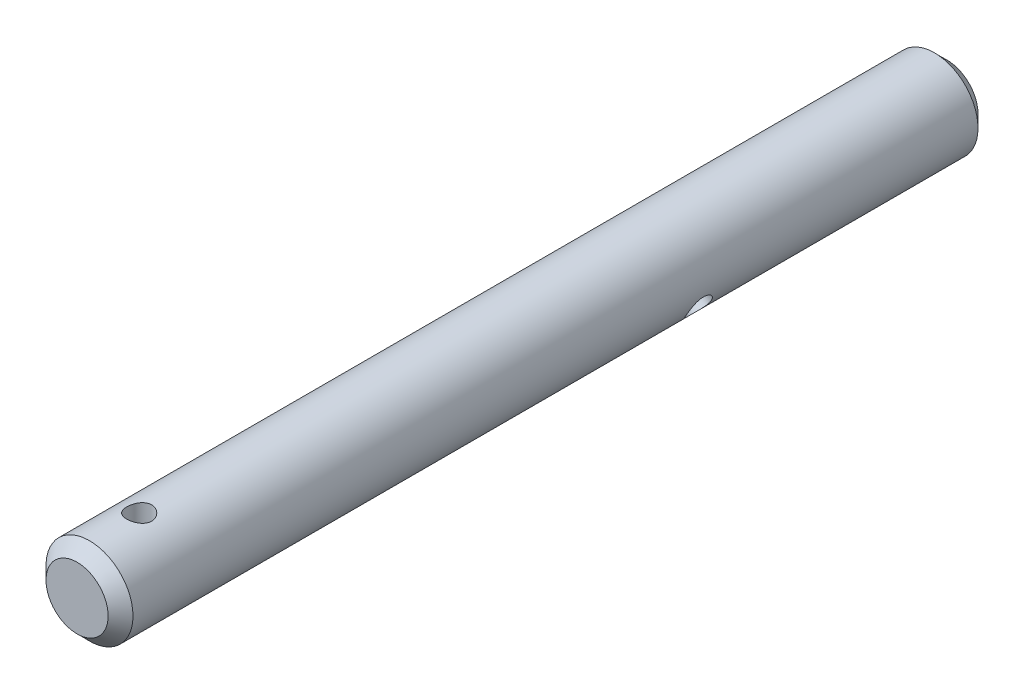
ISO-10303-21;
HEADER;
FILE_DESCRIPTION(('STEP AP214'),'2;1');
FILE_NAME('part.step','',(''),(''),'','','');
FILE_SCHEMA(('AUTOMOTIVE_DESIGN { 1 0 10303 214 1 1 1 1 }'));
ENDSEC;
DATA;
#1=APPLICATION_CONTEXT('core data for automotive mechanical design processes');
#2=APPLICATION_PROTOCOL_DEFINITION('international standard','automotive_design',2000,#1);
#3=PRODUCT_CONTEXT('',#1,'mechanical');
#4=PRODUCT('Part','Part','',(#3));
#5=PRODUCT_RELATED_PRODUCT_CATEGORY('part','',(#4));
#6=PRODUCT_DEFINITION_FORMATION('','',#4);
#7=PRODUCT_DEFINITION_CONTEXT('part definition',#1,'design');
#8=PRODUCT_DEFINITION('design','',#6,#7);
#9=PRODUCT_DEFINITION_SHAPE('','',#8);
#10=(LENGTH_UNIT() NAMED_UNIT(*) SI_UNIT(.MILLI.,.METRE.));
#11=(NAMED_UNIT(*) PLANE_ANGLE_UNIT() SI_UNIT($,.RADIAN.));
#12=(NAMED_UNIT(*) SI_UNIT($,.STERADIAN.) SOLID_ANGLE_UNIT());
#13=UNCERTAINTY_MEASURE_WITH_UNIT(LENGTH_MEASURE(1.E-05),#10,'distance_accuracy_value','');
#14=(GEOMETRIC_REPRESENTATION_CONTEXT(3) GLOBAL_UNCERTAINTY_ASSIGNED_CONTEXT((#13)) GLOBAL_UNIT_ASSIGNED_CONTEXT((#10,
#11,#12)) REPRESENTATION_CONTEXT('',''));
#15=CARTESIAN_POINT('',(0.,0.,0.));
#16=DIRECTION('',(0.,0.,1.));
#17=DIRECTION('',(1.,0.,0.));
#18=AXIS2_PLACEMENT_3D('',#15,#16,#17);
#19=CARTESIAN_POINT('',(0.,0.,69.9999999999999));
#20=DIRECTION('',(0.,0.,-1.));
#21=DIRECTION('',(-1.,0.,0.));
#22=AXIS2_PLACEMENT_3D('',#19,#20,#21);
#23=CYLINDRICAL_SURFACE('',#22,3.5);
#24=CARTESIAN_POINT('',(2.40473750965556,-2.54307638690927,23.));
#25=CARTESIAN_POINT('',(2.4047386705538,-2.54307591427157,23.0549257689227));
#26=CARTESIAN_POINT('',(2.40818904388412,-2.53982602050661,23.1098615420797));
#27=CARTESIAN_POINT('',(2.4217656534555,-2.52688273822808,23.2181356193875));
#28=CARTESIAN_POINT('',(2.43189460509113,-2.51718672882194,23.2714732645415));
#29=CARTESIAN_POINT('',(2.45816904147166,-2.49153342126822,23.3749686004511));
#30=CARTESIAN_POINT('',(2.47430520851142,-2.47558581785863,23.4251310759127));
#31=CARTESIAN_POINT('',(2.51167329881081,-2.43766344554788,23.521083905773));
#32=CARTESIAN_POINT('',(2.53290582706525,-2.41568796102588,23.5668737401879));
#33=CARTESIAN_POINT('',(2.5799853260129,-2.36535216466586,23.6540957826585));
#34=CARTESIAN_POINT('',(2.60593783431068,-2.33684082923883,23.6953839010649));
#35=CARTESIAN_POINT('',(2.66080552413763,-2.27416929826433,23.7711513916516));
#36=CARTESIAN_POINT('',(2.68972105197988,-2.24000844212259,23.8056299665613));
#37=CARTESIAN_POINT('',(2.74977472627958,-2.1658837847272,23.8674143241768));
#38=CARTESIAN_POINT('',(2.7809442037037,-2.12582389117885,23.8945748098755));
#39=CARTESIAN_POINT('',(2.84364186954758,-2.04119320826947,23.940000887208));
#40=CARTESIAN_POINT('',(2.87516998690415,-1.99662329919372,23.9582682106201));
#41=CARTESIAN_POINT('',(2.93647327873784,-1.90527427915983,23.9849172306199));
#42=CARTESIAN_POINT('',(2.96627272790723,-1.85858319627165,23.9935445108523));
#43=CARTESIAN_POINT('',(3.02391437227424,-1.76324762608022,24.0014433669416));
#44=CARTESIAN_POINT('',(3.0517569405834,-1.71460351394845,24.0007167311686));
#45=CARTESIAN_POINT('',(3.10389179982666,-1.6182617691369,23.9900968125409));
#46=CARTESIAN_POINT('',(3.12826346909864,-1.57057743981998,23.980469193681));
#47=CARTESIAN_POINT('',(3.17389396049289,-1.47619326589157,23.9527524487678));
#48=CARTESIAN_POINT('',(3.19515259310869,-1.42949348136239,23.9346628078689));
#49=CARTESIAN_POINT('',(3.23454562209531,-1.33799296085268,23.890345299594));
#50=CARTESIAN_POINT('',(3.25264331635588,-1.29321857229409,23.8640306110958));
#51=CARTESIAN_POINT('',(3.28543541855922,-1.20748661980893,23.804077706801));
#52=CARTESIAN_POINT('',(3.30012907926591,-1.16652989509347,23.7704378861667));
#53=CARTESIAN_POINT('',(3.32674298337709,-1.08836895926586,23.6953971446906));
#54=CARTESIAN_POINT('',(3.33854779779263,-1.05134688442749,23.6537652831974));
#55=CARTESIAN_POINT('',(3.35898852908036,-0.984090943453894,23.564642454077));
#56=CARTESIAN_POINT('',(3.36762418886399,-0.953857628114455,23.5171510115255));
#57=CARTESIAN_POINT('',(3.38210690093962,-0.901170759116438,23.4171345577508));
#58=CARTESIAN_POINT('',(3.38793113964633,-0.878781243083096,23.3645723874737));
#59=CARTESIAN_POINT('',(3.39697422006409,-0.843153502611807,23.2562234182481));
#60=CARTESIAN_POINT('',(3.40019381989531,-0.829912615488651,23.2004375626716));
#61=CARTESIAN_POINT('',(3.40415003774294,-0.813530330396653,23.0892597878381));
#62=CARTESIAN_POINT('',(3.4049674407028,-0.81006050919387,23.0339190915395));
#63=CARTESIAN_POINT('',(3.40439772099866,-0.812451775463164,22.9234558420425));
#64=CARTESIAN_POINT('',(3.4030108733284,-0.818311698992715,22.8683332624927));
#65=CARTESIAN_POINT('',(3.39801027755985,-0.83882785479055,22.7611793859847));
#66=CARTESIAN_POINT('',(3.39444824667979,-0.853279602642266,22.7091062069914));
#67=CARTESIAN_POINT('',(3.38496192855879,-0.890164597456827,22.6080990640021));
#68=CARTESIAN_POINT('',(3.37903730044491,-0.912598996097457,22.5591655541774));
#69=CARTESIAN_POINT('',(3.3643945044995,-0.965199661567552,22.4644889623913));
#70=CARTESIAN_POINT('',(3.35561084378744,-0.995543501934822,22.4188547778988));
#71=CARTESIAN_POINT('',(3.33499786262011,-1.06255152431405,22.3332618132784));
#72=CARTESIAN_POINT('',(3.3231678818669,-1.09921707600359,22.2933042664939));
#73=CARTESIAN_POINT('',(3.29573585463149,-1.17896532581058,22.2188102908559));
#74=CARTESIAN_POINT('',(3.28001991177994,-1.22222292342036,22.1845025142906));
#75=CARTESIAN_POINT('',(3.24486462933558,-1.31270936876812,22.1239771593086));
#76=CARTESIAN_POINT('',(3.22542548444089,-1.35993800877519,22.0977591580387));
#77=CARTESIAN_POINT('',(3.18301851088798,-1.45641526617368,22.0544078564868));
#78=CARTESIAN_POINT('',(3.1600791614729,-1.50564541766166,22.0372058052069));
#79=CARTESIAN_POINT('',(3.11088369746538,-1.60482477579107,22.0121865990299));
#80=CARTESIAN_POINT('',(3.08462843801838,-1.65477379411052,22.0043670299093));
#81=CARTESIAN_POINT('',(3.03041386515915,-1.75202256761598,21.9985042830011));
#82=CARTESIAN_POINT('',(3.00254658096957,-1.79935380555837,22.0001279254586));
#83=CARTESIAN_POINT('',(2.94516750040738,-1.89181094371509,22.0123191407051));
#84=CARTESIAN_POINT('',(2.91565578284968,-1.93693694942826,22.022886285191));
#85=CARTESIAN_POINT('',(2.85629541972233,-2.02343923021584,22.0524656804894));
#86=CARTESIAN_POINT('',(2.82645214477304,-2.06484542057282,22.071401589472));
#87=CARTESIAN_POINT('',(2.76728652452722,-2.14349008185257,22.1171130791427));
#88=CARTESIAN_POINT('',(2.73796426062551,-2.1807279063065,22.1438898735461));
#89=CARTESIAN_POINT('',(2.68015347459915,-2.25142756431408,22.2054486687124));
#90=CARTESIAN_POINT('',(2.65171567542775,-2.2847441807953,22.2404450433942));
#91=CARTESIAN_POINT('',(2.59788244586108,-2.34577626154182,22.317054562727));
#92=CARTESIAN_POINT('',(2.57248785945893,-2.37349017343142,22.3586695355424));
#93=CARTESIAN_POINT('',(2.52536251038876,-2.42358419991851,22.4486484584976));
#94=CARTESIAN_POINT('',(2.50374550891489,-2.44580508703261,22.4971609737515));
#95=CARTESIAN_POINT('',(2.46625411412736,-2.48360702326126,22.5987609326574));
#96=CARTESIAN_POINT('',(2.45037650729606,-2.49919178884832,22.6518457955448));
#97=CARTESIAN_POINT('',(2.42701722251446,-2.5218674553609,22.7538268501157));
#98=CARTESIAN_POINT('',(2.41870145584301,-2.52981057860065,22.8023451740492));
#99=CARTESIAN_POINT('',(2.40756150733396,-2.54041484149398,22.9005730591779));
#100=CARTESIAN_POINT('',(2.40473645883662,-2.54307681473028,22.950282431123));
#101=CARTESIAN_POINT('',(2.40473750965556,-2.54307638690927,23.));
#102=B_SPLINE_CURVE_WITH_KNOTS('',3,(#24,#25,#26,#27,#28,#29,#30,#31,#32,#33,#34,#35,#36,#37,
#38,#39,#40,#41,#42,#43,#44,#45,#46,#47,#48,#49,#50,#51,#52,#53,#54,#55,#56,#57,#58,#59,#60,#61,
#62,#63,#64,#65,#66,#67,#68,#69,#70,#71,#72,#73,#74,#75,#76,#77,#78,#79,#80,#81,#82,#83,#84,#85,
#86,#87,#88,#89,#90,#91,#92,#93,#94,#95,#96,#97,#98,#99,#100,#101),.UNSPECIFIED.,.T.,.F.,(4,2,2,
2,2,2,2,2,2,2,2,2,2,2,2,2,2,2,2,2,2,2,2,2,2,2,2,2,2,2,2,2,2,2,2,2,2,2,4),(0.,0.164594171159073,
0.329255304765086,0.493662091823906,0.658088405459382,0.826785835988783,0.995503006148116,
1.16735741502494,1.33917834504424,1.50651450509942,1.67381867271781,1.83628518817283,
1.99876158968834,2.16301451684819,2.32730346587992,2.49735806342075,2.66742645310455,
2.83885260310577,3.01022883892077,3.17577181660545,3.34129414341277,3.50302644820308,
3.66478209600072,3.83054003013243,3.99633392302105,4.16772694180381,4.33911100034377,
4.50916842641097,4.67918208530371,4.84323448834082,5.00727903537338,5.16985706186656,
5.33246026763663,5.49989884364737,5.66738374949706,5.83926806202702,6.01105598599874,
6.16006644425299,6.30905338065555),.UNSPECIFIED.);
#103=CARTESIAN_POINT('',(2.40473750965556,-2.54307638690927,23.));
#104=VERTEX_POINT('',#103);
#105=EDGE_CURVE('E32',#104,#104,#102,.T.);
#106=ORIENTED_EDGE('',*,*,#105,.T.);
#107=EDGE_LOOP('',(#106));
#108=FACE_BOUND('',#107,.T.);
#109=CARTESIAN_POINT('',(-3.40473750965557,0.811025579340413,23.));
#110=CARTESIAN_POINT('',(-3.40473768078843,0.811026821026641,22.9450742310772));
#111=CARTESIAN_POINT('',(-3.40364837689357,0.81563987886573,22.8901384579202));
#112=CARTESIAN_POINT('',(-3.3992274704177,0.833869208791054,22.7818643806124));
#113=CARTESIAN_POINT('',(-3.39589495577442,0.847489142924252,22.7285267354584));
#114=CARTESIAN_POINT('',(-3.38681575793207,0.883070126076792,22.6250313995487));
#115=CARTESIAN_POINT('',(-3.3810728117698,0.905018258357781,22.5748689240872));
#116=CARTESIAN_POINT('',(-3.36691511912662,0.956341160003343,22.4789160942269));
#117=CARTESIAN_POINT('',(-3.35850005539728,0.985716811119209,22.433126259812));
#118=CARTESIAN_POINT('',(-3.3384477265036,1.05165675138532,22.3459042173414));
#119=CARTESIAN_POINT('',(-3.3267324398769,1.08838795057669,22.304616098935));
#120=CARTESIAN_POINT('',(-3.29989114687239,1.16724052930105,22.2288486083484));
#121=CARTESIAN_POINT('',(-3.28476474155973,1.20936253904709,22.1943700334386));
#122=CARTESIAN_POINT('',(-3.25059774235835,1.2984328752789,22.1325856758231));
#123=CARTESIAN_POINT('',(-3.23148959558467,1.3454563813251,22.1054251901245));
#124=CARTESIAN_POINT('',(-3.18954610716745,1.44206949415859,22.059999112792));
#125=CARTESIAN_POINT('',(-3.16671149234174,1.49165859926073,22.0417317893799));
#126=CARTESIAN_POINT('',(-3.11825256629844,1.59042331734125,22.0150827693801));
#127=CARTESIAN_POINT('',(-3.0927166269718,1.63957593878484,22.0064554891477));
#128=CARTESIAN_POINT('',(-3.03897442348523,1.73716285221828,21.9985566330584));
#129=CARTESIAN_POINT('',(-3.01076867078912,1.78559727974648,21.9992832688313));
#130=CARTESIAN_POINT('',(-2.95340170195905,1.87891826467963,22.009903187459));
#131=CARTESIAN_POINT('',(-2.92429169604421,1.92386691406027,22.019530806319));
#132=CARTESIAN_POINT('',(-2.86536784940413,2.01057616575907,22.0472475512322));
#133=CARTESIAN_POINT('',(-2.83555396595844,2.05233657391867,22.065337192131));
#134=CARTESIAN_POINT('',(-2.77600870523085,2.13220219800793,22.1096547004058));
#135=CARTESIAN_POINT('',(-2.74628179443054,2.17026245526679,22.1359693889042));
#136=CARTESIAN_POINT('',(-2.68843179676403,2.24152722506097,22.195922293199));
#137=CARTESIAN_POINT('',(-2.66030906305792,2.27473067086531,22.2295621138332));
#138=CARTESIAN_POINT('',(-2.60592665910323,2.33685945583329,22.3046028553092));
#139=CARTESIAN_POINT('',(-2.57976700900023,2.36559376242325,22.3462347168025));
#140=CARTESIAN_POINT('',(-2.53174202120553,2.41692392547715,22.4353575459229));
#141=CARTESIAN_POINT('',(-2.50987703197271,2.43951928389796,22.4828489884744));
#142=CARTESIAN_POINT('',(-2.47149022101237,2.47840511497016,22.5828654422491));
#143=CARTESIAN_POINT('',(-2.45501245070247,2.49464381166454,22.6354276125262));
#144=CARTESIAN_POINT('',(-2.42867946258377,2.52028921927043,22.7437765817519));
#145=CARTESIAN_POINT('',(-2.41882231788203,2.52969791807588,22.7995624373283));
#146=CARTESIAN_POINT('',(-2.40661295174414,2.54131524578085,22.9107402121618));
#147=CARTESIAN_POINT('',(-2.4040166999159,2.5437580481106,22.9660809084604));
#148=CARTESIAN_POINT('',(-2.40580273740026,2.54206902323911,23.0765441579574));
#149=CARTESIAN_POINT('',(-2.41018415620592,2.53793801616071,23.1316667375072));
#150=CARTESIAN_POINT('',(-2.42545137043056,2.52334929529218,23.2388206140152));
#151=CARTESIAN_POINT('',(-2.43618593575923,2.51303861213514,23.2908937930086));
#152=CARTESIAN_POINT('',(-2.46338611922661,2.48638072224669,23.3919009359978));
#153=CARTESIAN_POINT('',(-2.47985256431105,2.47003264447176,23.4408344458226));
#154=CARTESIAN_POINT('',(-2.51808467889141,2.43105127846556,23.5355110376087));
#155=CARTESIAN_POINT('',(-2.53997138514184,2.40827248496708,23.5811452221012));
#156=CARTESIAN_POINT('',(-2.58769554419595,2.35691710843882,23.6667381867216));
#157=CARTESIAN_POINT('',(-2.61353385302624,2.32833926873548,23.706695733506));
#158=CARTESIAN_POINT('',(-2.66888184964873,2.26470831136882,23.7811897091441));
#159=CARTESIAN_POINT('',(-2.69848605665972,2.2294691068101,23.8154974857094));
#160=CARTESIAN_POINT('',(-2.75927197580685,2.15378051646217,23.8760228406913));
#161=CARTESIAN_POINT('',(-2.79045360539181,2.11333140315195,23.9022408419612));
#162=CARTESIAN_POINT('',(-2.85280187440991,2.02836725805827,23.9455921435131));
#163=CARTESIAN_POINT('',(-2.88396676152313,1.98388612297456,23.9627941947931));
#164=CARTESIAN_POINT('',(-2.94526087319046,1.89169192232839,23.9878134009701));
#165=CARTESIAN_POINT('',(-2.97539036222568,1.84397969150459,23.9956329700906));
#166=CARTESIAN_POINT('',(-3.03250298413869,1.74840410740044,24.0014957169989));
#167=CARTESIAN_POINT('',(-3.0595593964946,1.7006047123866,23.9998720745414));
#168=CARTESIAN_POINT('',(-3.11094008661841,1.60468440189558,23.9876808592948));
#169=CARTESIAN_POINT('',(-3.13526449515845,1.55656350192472,23.9771137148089));
#170=CARTESIAN_POINT('',(-3.18049748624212,1.46190477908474,23.9475343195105));
#171=CARTESIAN_POINT('',(-3.2014346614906,1.41535664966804,23.928598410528));
#172=CARTESIAN_POINT('',(-3.239960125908,1.32479538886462,23.8828869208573));
#173=CARTESIAN_POINT('',(-3.25754789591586,1.28078265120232,23.8561101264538));
#174=CARTESIAN_POINT('',(-3.28987020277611,1.19536721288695,23.7945513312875));
#175=CARTESIAN_POINT('',(-3.30450433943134,1.15408104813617,23.7595549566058));
#176=CARTESIAN_POINT('',(-3.33044305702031,1.07694406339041,23.682945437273));
#177=CARTESIAN_POINT('',(-3.34174671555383,1.04109475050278,23.6413304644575));
#178=CARTESIAN_POINT('',(-3.36156674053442,0.975235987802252,23.5513515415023));
#179=CARTESIAN_POINT('',(-3.37000209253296,0.945404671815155,23.5028390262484));
#180=CARTESIAN_POINT('',(-3.38399383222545,0.89403520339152,23.4012390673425));
#181=CARTESIAN_POINT('',(-3.38955183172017,0.872492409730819,23.3481542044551));
#182=CARTESIAN_POINT('',(-3.39750989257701,0.840924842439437,23.2461731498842));
#183=CARTESIAN_POINT('',(-3.40023095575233,0.829751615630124,23.1976548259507));
#184=CARTESIAN_POINT('',(-3.40384454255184,0.814802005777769,23.099426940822));
#185=CARTESIAN_POINT('',(-3.40473735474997,0.811024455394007,23.049717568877));
#186=CARTESIAN_POINT('',(-3.40473750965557,0.811025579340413,23.));
#187=B_SPLINE_CURVE_WITH_KNOTS('',3,(#109,#110,#111,#112,#113,#114,#115,#116,#117,#118,#119,
#120,#121,#122,#123,#124,#125,#126,#127,#128,#129,#130,#131,#132,#133,#134,#135,#136,#137,#138,
#139,#140,#141,#142,#143,#144,#145,#146,#147,#148,#149,#150,#151,#152,#153,#154,#155,#156,#157,
#158,#159,#160,#161,#162,#163,#164,#165,#166,#167,#168,#169,#170,#171,#172,#173,#174,#175,#176,
#177,#178,#179,#180,#181,#182,#183,#184,#185,#186),.UNSPECIFIED.,.T.,.F.,(4,2,2,2,2,2,2,2,2,2,2,
2,2,2,2,2,2,2,2,2,2,2,2,2,2,2,2,2,2,2,2,2,2,2,2,2,2,2,4),(0.,0.164594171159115,
0.329255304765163,0.493662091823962,0.658088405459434,0.826785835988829,0.995503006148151,
1.16735741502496,1.33917834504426,1.50651450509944,1.67381867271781,1.83628518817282,
1.99876158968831,2.16301451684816,2.32730346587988,2.49735806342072,2.66742645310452,
2.83885260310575,3.01022883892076,3.17577181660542,3.34129414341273,3.50302644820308,
3.66478209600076,3.83054003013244,3.99633392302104,4.16772694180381,4.33911100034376,
4.50916842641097,4.67918208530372,4.84323448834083,5.00727903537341,5.1698570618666,
5.33246026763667,5.49989884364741,5.66738374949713,5.8392680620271,6.01105598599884,
6.16006644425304,6.30905338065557),.UNSPECIFIED.);
#188=CARTESIAN_POINT('',(-3.40473750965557,0.811025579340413,23.));
#189=VERTEX_POINT('',#188);
#190=EDGE_CURVE('E93',#189,#189,#187,.T.);
#191=ORIENTED_EDGE('',*,*,#190,.T.);
#192=EDGE_LOOP('',(#191));
#193=FACE_BOUND('',#192,.T.);
#194=CARTESIAN_POINT('',(0.,-3.5,66.));
#195=CARTESIAN_POINT('',(0.0549774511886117,-3.49999934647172,65.999999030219));
#196=CARTESIAN_POINT('',(0.10996487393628,-3.49869208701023,65.9954511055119));
#197=CARTESIAN_POINT('',(0.218345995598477,-3.49360452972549,65.9774178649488));
#198=CARTESIAN_POINT('',(0.27173908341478,-3.48982329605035,65.9639291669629));
#199=CARTESIAN_POINT('',(0.375352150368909,-3.48020345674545,65.9284959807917));
#200=CARTESIAN_POINT('',(0.425576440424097,-3.47436772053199,65.9065632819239));
#201=CARTESIAN_POINT('',(0.521634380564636,-3.46124989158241,65.8549110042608));
#202=CARTESIAN_POINT('',(0.567467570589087,-3.45396764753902,65.8251906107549));
#203=CARTESIAN_POINT('',(0.65464722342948,-3.43852367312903,65.7579824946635));
#204=CARTESIAN_POINT('',(0.695861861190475,-3.43034520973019,65.7203276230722));
#205=CARTESIAN_POINT('',(0.771485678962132,-3.41413367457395,65.6386761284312));
#206=CARTESIAN_POINT('',(0.805893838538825,-3.40610062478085,65.5946785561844));
#207=CARTESIAN_POINT('',(0.867598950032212,-3.39091507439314,65.5005032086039));
#208=CARTESIAN_POINT('',(0.894739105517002,-3.38378351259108,65.4502190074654));
#209=CARTESIAN_POINT('',(0.940125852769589,-3.37145671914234,65.3455639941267));
#210=CARTESIAN_POINT('',(0.958374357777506,-3.36626107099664,65.2911940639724));
#211=CARTESIAN_POINT('',(0.984992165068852,-3.35856804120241,65.1813826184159));
#212=CARTESIAN_POINT('',(0.993602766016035,-3.35600489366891,65.1260043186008));
#213=CARTESIAN_POINT('',(1.00145333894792,-3.35367104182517,65.0145344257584));
#214=CARTESIAN_POINT('',(1.00069534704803,-3.35389973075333,64.9584429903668));
#215=CARTESIAN_POINT('',(0.990020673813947,-3.35706517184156,64.8490656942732));
#216=CARTESIAN_POINT('',(0.980401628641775,-3.35991391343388,64.79574782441));
#217=CARTESIAN_POINT('',(0.952756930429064,-3.36785674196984,64.6915163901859));
#218=CARTESIAN_POINT('',(0.934730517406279,-3.37295103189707,64.6406030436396));
#219=CARTESIAN_POINT('',(0.890553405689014,-3.38488431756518,64.5418768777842));
#220=CARTESIAN_POINT('',(0.864302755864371,-3.39174458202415,64.4941114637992));
#221=CARTESIAN_POINT('',(0.804491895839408,-3.40642608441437,64.4035617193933));
#222=CARTESIAN_POINT('',(0.770930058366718,-3.41424753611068,64.3607785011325));
#223=CARTESIAN_POINT('',(0.695951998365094,-3.43033125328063,64.2797138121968));
#224=CARTESIAN_POINT('',(0.654287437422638,-3.43859902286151,64.2416627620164));
#225=CARTESIAN_POINT('',(0.56506614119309,-3.45438123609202,64.1730369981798));
#226=CARTESIAN_POINT('',(0.517509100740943,-3.46189564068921,64.1424626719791));
#227=CARTESIAN_POINT('',(0.417461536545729,-3.47538264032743,64.0895356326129));
#228=CARTESIAN_POINT('',(0.364944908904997,-3.48134637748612,64.0672298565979));
#229=CARTESIAN_POINT('',(0.256696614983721,-3.49099625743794,64.0318330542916));
#230=CARTESIAN_POINT('',(0.200965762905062,-3.49468297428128,64.0187397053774));
#231=CARTESIAN_POINT('',(0.0898331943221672,-3.49927437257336,64.0025133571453));
#232=CARTESIAN_POINT('',(0.0344806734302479,-3.500266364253,63.9990676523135));
#233=CARTESIAN_POINT('',(-0.0760132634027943,-3.49961042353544,64.0013636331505));
#234=CARTESIAN_POINT('',(-0.131154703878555,-3.49796280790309,64.0071042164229));
#235=CARTESIAN_POINT('',(-0.23850931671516,-3.4922696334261,64.0273552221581));
#236=CARTESIAN_POINT('',(-0.290759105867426,-3.48827306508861,64.0416865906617));
#237=CARTESIAN_POINT('',(-0.392104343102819,-3.47833999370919,64.0785002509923));
#238=CARTESIAN_POINT('',(-0.44119942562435,-3.47240326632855,64.1009834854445));
#239=CARTESIAN_POINT('',(-0.536020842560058,-3.45904980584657,64.1540116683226));
#240=CARTESIAN_POINT('',(-0.581651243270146,-3.45160381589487,64.1847205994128));
#241=CARTESIAN_POINT('',(-0.667219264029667,-3.43608973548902,64.2531262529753));
#242=CARTESIAN_POINT('',(-0.707155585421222,-3.42802150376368,64.2908245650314));
#243=CARTESIAN_POINT('',(-0.781553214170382,-3.41184309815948,64.3736046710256));
#244=CARTESIAN_POINT('',(-0.815792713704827,-3.40374018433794,64.4188876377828));
#245=CARTESIAN_POINT('',(-0.876197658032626,-3.3886944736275,64.514731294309));
#246=CARTESIAN_POINT('',(-0.902363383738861,-3.38175163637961,64.5652918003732));
#247=CARTESIAN_POINT('',(-0.945687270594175,-3.36989325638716,64.6700456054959));
#248=CARTESIAN_POINT('',(-0.962893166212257,-3.36496700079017,64.7242178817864));
#249=CARTESIAN_POINT('',(-0.987897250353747,-3.35771228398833,64.8348549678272));
#250=CARTESIAN_POINT('',(-0.995698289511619,-3.35538303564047,64.891319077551));
#251=CARTESIAN_POINT('',(-1.00149012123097,-3.35365851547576,65.0026480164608));
#252=CARTESIAN_POINT('',(-0.999840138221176,-3.35415580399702,65.0574927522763));
#253=CARTESIAN_POINT('',(-0.987623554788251,-3.35777298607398,65.1660873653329));
#254=CARTESIAN_POINT('',(-0.977057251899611,-3.36089279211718,65.2198372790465));
#255=CARTESIAN_POINT('',(-0.94752984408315,-3.36933488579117,65.3241891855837));
#256=CARTESIAN_POINT('',(-0.928655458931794,-3.37463438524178,65.3748176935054));
#257=CARTESIAN_POINT('',(-0.883114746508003,-3.38683651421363,65.4722293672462));
#258=CARTESIAN_POINT('',(-0.856447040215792,-3.3937394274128,65.5190118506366));
#259=CARTESIAN_POINT('',(-0.795032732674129,-3.40865834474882,65.6090917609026));
#260=CARTESIAN_POINT('',(-0.760046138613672,-3.41670381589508,65.652220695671));
#261=CARTESIAN_POINT('',(-0.683429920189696,-3.43284922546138,65.7321119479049));
#262=CARTESIAN_POINT('',(-0.641798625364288,-3.4409491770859,65.7688726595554));
#263=CARTESIAN_POINT('',(-0.551787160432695,-3.45653979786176,65.8359185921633));
#264=CARTESIAN_POINT('',(-0.50326125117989,-3.46400950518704,65.8660134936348));
#265=CARTESIAN_POINT('',(-0.401625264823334,-3.47725697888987,65.917572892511));
#266=CARTESIAN_POINT('',(-0.348517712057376,-3.48303566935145,65.9390421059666));
#267=CARTESIAN_POINT('',(-0.246458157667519,-3.49163672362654,65.9704237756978));
#268=CARTESIAN_POINT('',(-0.197881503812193,-3.49474842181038,65.9814867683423));
#269=CARTESIAN_POINT('',(-0.099539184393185,-3.49893021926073,65.996274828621));
#270=CARTESIAN_POINT('',(-0.049773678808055,-3.50000059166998,66.0000008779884));
#271=CARTESIAN_POINT('',(0.,-3.5,66.));
#272=B_SPLINE_CURVE_WITH_KNOTS('',3,(#194,#195,#196,#197,#198,#199,#200,#201,#202,#203,#204,
#205,#206,#207,#208,#209,#210,#211,#212,#213,#214,#215,#216,#217,#218,#219,#220,#221,#222,#223,
#224,#225,#226,#227,#228,#229,#230,#231,#232,#233,#234,#235,#236,#237,#238,#239,#240,#241,#242,
#243,#244,#245,#246,#247,#248,#249,#250,#251,#252,#253,#254,#255,#256,#257,#258,#259,#260,#261,
#262,#263,#264,#265,#266,#267,#268,#269,#270,#271),.UNSPECIFIED.,.T.,.F.,(4,2,2,2,2,2,2,2,2,2,2,
2,2,2,2,2,2,2,2,2,2,2,2,2,2,2,2,2,2,2,2,2,2,2,2,2,2,2,4),(0.,0.164749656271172,
0.329561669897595,0.494144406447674,0.658744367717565,0.827239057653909,0.995758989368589,
1.16766537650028,1.33953475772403,1.50699754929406,1.67442394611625,1.83642392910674,
1.9984385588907,2.16250401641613,2.3266060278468,2.4968925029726,2.66718780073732,
2.83843550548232,3.00964002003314,3.17522728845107,3.34079468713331,3.50302570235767,
3.66527548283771,3.83103762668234,3.99683751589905,4.16806052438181,4.33927757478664,
4.5095728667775,4.67981652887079,4.84363340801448,5.00744482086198,5.16958548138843,
5.33175484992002,5.49933828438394,5.66696391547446,5.83888989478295,6.01072174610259,
6.15989734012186,6.30905297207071),.UNSPECIFIED.);
#273=CARTESIAN_POINT('',(0.,-3.5,66.));
#274=VERTEX_POINT('',#273);
#275=EDGE_CURVE('E54',#274,#274,#272,.T.);
#276=ORIENTED_EDGE('',*,*,#275,.T.);
#277=EDGE_LOOP('',(#276));
#278=FACE_BOUND('',#277,.T.);
#279=CARTESIAN_POINT('',(0.,3.50000000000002,66.));
#280=CARTESIAN_POINT('',(-0.054977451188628,3.49999934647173,65.999999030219));
#281=CARTESIAN_POINT('',(-0.109964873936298,3.49869208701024,65.9954511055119));
#282=CARTESIAN_POINT('',(-0.218345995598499,3.4936045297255,65.9774178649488));
#283=CARTESIAN_POINT('',(-0.271739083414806,3.48982329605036,65.9639291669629));
#284=CARTESIAN_POINT('',(-0.375352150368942,3.48020345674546,65.9284959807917));
#285=CARTESIAN_POINT('',(-0.425576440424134,3.47436772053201,65.906563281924));
#286=CARTESIAN_POINT('',(-0.521634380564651,3.46124989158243,65.8549110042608));
#287=CARTESIAN_POINT('',(-0.567467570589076,3.45396764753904,65.8251906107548));
#288=CARTESIAN_POINT('',(-0.654647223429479,3.43852367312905,65.7579824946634));
#289=CARTESIAN_POINT('',(-0.695861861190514,3.43034520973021,65.7203276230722));
#290=CARTESIAN_POINT('',(-0.771485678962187,3.41413367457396,65.6386761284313));
#291=CARTESIAN_POINT('',(-0.805893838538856,3.40610062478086,65.5946785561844));
#292=CARTESIAN_POINT('',(-0.867598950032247,3.39091507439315,65.500503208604));
#293=CARTESIAN_POINT('',(-0.894739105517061,3.38378351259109,65.4502190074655));
#294=CARTESIAN_POINT('',(-0.940125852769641,3.37145671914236,65.3455639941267));
#295=CARTESIAN_POINT('',(-0.958374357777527,3.36626107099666,65.2911940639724));
#296=CARTESIAN_POINT('',(-0.984992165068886,3.35856804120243,65.1813826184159));
#297=CARTESIAN_POINT('',(-0.993602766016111,3.35600489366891,65.1260043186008));
#298=CARTESIAN_POINT('',(-1.00145333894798,3.35367104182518,65.0145344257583));
#299=CARTESIAN_POINT('',(-1.00069534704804,3.35389973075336,64.9584429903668));
#300=CARTESIAN_POINT('',(-0.990020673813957,3.35706517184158,64.8490656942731));
#301=CARTESIAN_POINT('',(-0.980401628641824,3.3599139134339,64.7957478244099));
#302=CARTESIAN_POINT('',(-0.952756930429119,3.36785674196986,64.6915163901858));
#303=CARTESIAN_POINT('',(-0.934730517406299,3.37295103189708,64.6406030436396));
#304=CARTESIAN_POINT('',(-0.890553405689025,3.3848843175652,64.5418768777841));
#305=CARTESIAN_POINT('',(-0.864302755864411,3.39174458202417,64.4941114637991));
#306=CARTESIAN_POINT('',(-0.804491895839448,3.40642608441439,64.4035617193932));
#307=CARTESIAN_POINT('',(-0.770930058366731,3.4142475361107,64.3607785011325));
#308=CARTESIAN_POINT('',(-0.695951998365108,3.43033125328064,64.2797138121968));
#309=CARTESIAN_POINT('',(-0.654287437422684,3.43859902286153,64.2416627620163));
#310=CARTESIAN_POINT('',(-0.565066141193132,3.45438123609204,64.1730369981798));
#311=CARTESIAN_POINT('',(-0.517509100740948,3.46189564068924,64.1424626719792));
#312=CARTESIAN_POINT('',(-0.41746153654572,3.47538264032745,64.089535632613));
#313=CARTESIAN_POINT('',(-0.364944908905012,3.48134637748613,64.0672298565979));
#314=CARTESIAN_POINT('',(-0.256696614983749,3.49099625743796,64.0318330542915));
#315=CARTESIAN_POINT('',(-0.200965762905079,3.49468297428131,64.0187397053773));
#316=CARTESIAN_POINT('',(-0.0898331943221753,3.49927437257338,64.0025133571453));
#317=CARTESIAN_POINT('',(-0.0344806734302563,3.50026636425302,63.9990676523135));
#318=CARTESIAN_POINT('',(0.076013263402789,3.49961042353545,64.0013636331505));
#319=CARTESIAN_POINT('',(0.131154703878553,3.49796280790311,64.0071042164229));
#320=CARTESIAN_POINT('',(0.238509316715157,3.49226963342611,64.0273552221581));
#321=CARTESIAN_POINT('',(0.29075910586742,3.48827306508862,64.0416865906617));
#322=CARTESIAN_POINT('',(0.392104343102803,3.4783399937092,64.0785002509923));
#323=CARTESIAN_POINT('',(0.441199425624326,3.47240326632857,64.1009834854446));
#324=CARTESIAN_POINT('',(0.536020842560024,3.45904980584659,64.1540116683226));
#325=CARTESIAN_POINT('',(0.581651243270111,3.45160381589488,64.1847205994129));
#326=CARTESIAN_POINT('',(0.667219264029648,3.43608973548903,64.2531262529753));
#327=CARTESIAN_POINT('',(0.707155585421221,3.4280215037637,64.2908245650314));
#328=CARTESIAN_POINT('',(0.781553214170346,3.4118430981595,64.3736046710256));
#329=CARTESIAN_POINT('',(0.815792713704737,3.40374018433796,64.4188876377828));
#330=CARTESIAN_POINT('',(0.876197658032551,3.38869447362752,64.514731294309));
#331=CARTESIAN_POINT('',(0.902363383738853,3.38175163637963,64.5652918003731));
#332=CARTESIAN_POINT('',(0.945687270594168,3.36989325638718,64.6700456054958));
#333=CARTESIAN_POINT('',(0.962893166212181,3.3649670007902,64.7242178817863));
#334=CARTESIAN_POINT('',(0.987897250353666,3.35771228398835,64.8348549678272));
#335=CARTESIAN_POINT('',(0.995698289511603,3.35538303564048,64.891319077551));
#336=CARTESIAN_POINT('',(1.00149012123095,3.35365851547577,65.0026480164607));
#337=CARTESIAN_POINT('',(0.999840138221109,3.35415580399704,65.0574927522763));
#338=CARTESIAN_POINT('',(0.987623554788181,3.357772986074,65.1660873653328));
#339=CARTESIAN_POINT('',(0.977057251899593,3.36089279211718,65.2198372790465));
#340=CARTESIAN_POINT('',(0.94752984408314,3.36933488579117,65.3241891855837));
#341=CARTESIAN_POINT('',(0.928655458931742,3.3746343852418,65.3748176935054));
#342=CARTESIAN_POINT('',(0.883114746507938,3.38683651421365,65.4722293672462));
#343=CARTESIAN_POINT('',(0.856447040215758,3.39373942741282,65.5190118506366));
#344=CARTESIAN_POINT('',(0.795032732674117,3.40865834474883,65.6090917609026));
#345=CARTESIAN_POINT('',(0.760046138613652,3.41670381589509,65.6522206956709));
#346=CARTESIAN_POINT('',(0.683429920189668,3.43284922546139,65.7321119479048));
#347=CARTESIAN_POINT('',(0.641798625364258,3.44094917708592,65.7688726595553));
#348=CARTESIAN_POINT('',(0.551787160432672,3.45653979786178,65.8359185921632));
#349=CARTESIAN_POINT('',(0.503261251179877,3.46400950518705,65.8660134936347));
#350=CARTESIAN_POINT('',(0.401625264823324,3.47725697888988,65.917572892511));
#351=CARTESIAN_POINT('',(0.348517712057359,3.48303566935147,65.9390421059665));
#352=CARTESIAN_POINT('',(0.246458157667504,3.49163672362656,65.9704237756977));
#353=CARTESIAN_POINT('',(0.197881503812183,3.49474842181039,65.9814867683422));
#354=CARTESIAN_POINT('',(0.099539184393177,3.49893021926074,65.996274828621));
#355=CARTESIAN_POINT('',(0.0497736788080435,3.50000059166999,66.0000008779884));
#356=CARTESIAN_POINT('',(0.,3.50000000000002,66.));
#357=B_SPLINE_CURVE_WITH_KNOTS('',3,(#279,#280,#281,#282,#283,#284,#285,#286,#287,#288,#289,
#290,#291,#292,#293,#294,#295,#296,#297,#298,#299,#300,#301,#302,#303,#304,#305,#306,#307,#308,
#309,#310,#311,#312,#313,#314,#315,#316,#317,#318,#319,#320,#321,#322,#323,#324,#325,#326,#327,
#328,#329,#330,#331,#332,#333,#334,#335,#336,#337,#338,#339,#340,#341,#342,#343,#344,#345,#346,
#347,#348,#349,#350,#351,#352,#353,#354,#355,#356),.UNSPECIFIED.,.T.,.F.,(4,2,2,2,2,2,2,2,2,2,2,
2,2,2,2,2,2,2,2,2,2,2,2,2,2,2,2,2,2,2,2,2,2,2,2,2,2,2,4),(0.,0.164749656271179,
0.329561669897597,0.494144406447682,0.658744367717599,0.827239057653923,0.995758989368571,
1.16766537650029,1.33953475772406,1.50699754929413,1.67442394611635,1.83642392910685,
1.9984385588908,2.16250401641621,2.32660602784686,2.49689250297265,2.66718780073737,
2.83843550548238,3.0096400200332,3.17522728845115,3.34079468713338,3.50302570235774,
3.66527548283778,3.83103762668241,3.99683751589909,4.16806052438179,4.33927757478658,
4.5095728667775,4.67981652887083,4.8436334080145,5.007444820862,5.16958548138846,
5.33175484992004,5.49933828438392,5.66696391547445,5.83888989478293,6.01072174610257,
6.15989734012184,6.3090529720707),.UNSPECIFIED.);
#358=CARTESIAN_POINT('',(0.,3.50000000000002,66.));
#359=VERTEX_POINT('',#358);
#360=EDGE_CURVE('E48',#359,#359,#357,.T.);
#361=ORIENTED_EDGE('',*,*,#360,.T.);
#362=EDGE_LOOP('',(#361));
#363=FACE_BOUND('',#362,.T.);
#364=CARTESIAN_POINT('',(0.,0.,69.));
#365=DIRECTION('',(0.,0.,1.));
#366=DIRECTION('',(1.,0.,0.));
#367=AXIS2_PLACEMENT_3D('',#364,#365,#366);
#368=CIRCLE('',#367,3.5);
#369=CARTESIAN_POINT('',(3.5,0.,69.));
#370=VERTEX_POINT('',#369);
#371=EDGE_CURVE('E10',#370,#370,#368,.F.);
#372=ORIENTED_EDGE('',*,*,#371,.T.);
#373=EDGE_LOOP('',(#372));
#374=FACE_BOUND('',#373,.T.);
#375=CARTESIAN_POINT('',(0.,0.,0.999999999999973));
#376=DIRECTION('',(0.,0.,1.));
#377=DIRECTION('',(1.,0.,0.));
#378=AXIS2_PLACEMENT_3D('',#375,#376,#377);
#379=CIRCLE('',#378,3.5);
#380=CARTESIAN_POINT('',(3.50000000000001,0.,0.999999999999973));
#381=VERTEX_POINT('',#380);
#382=EDGE_CURVE('E101',#381,#381,#379,.T.);
#383=ORIENTED_EDGE('',*,*,#382,.T.);
#384=EDGE_LOOP('',(#383));
#385=FACE_BOUND('',#384,.T.);
#386=ADVANCED_FACE('F28',(#108,#193,#278,#363,#374,#385),#23,.T.);
#387=CARTESIAN_POINT('',(0.,0.,69.9999999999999));
#388=DIRECTION('',(0.,0.,1.));
#389=DIRECTION('',(1.,0.,0.));
#390=AXIS2_PLACEMENT_3D('',#387,#388,#389);
#391=PLANE('',#390);
#392=CARTESIAN_POINT('',(0.,0.,69.9999999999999));
#393=DIRECTION('',(0.,0.,1.));
#394=DIRECTION('',(1.,0.,0.));
#395=AXIS2_PLACEMENT_3D('',#392,#393,#394);
#396=CIRCLE('',#395,2.49999999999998);
#397=CARTESIAN_POINT('',(2.49999999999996,0.,69.9999999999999));
#398=VERTEX_POINT('',#397);
#399=EDGE_CURVE('E39',#398,#398,#396,.T.);
#400=ORIENTED_EDGE('',*,*,#399,.T.);
#401=EDGE_LOOP('',(#400));
#402=FACE_BOUND('',#401,.T.);
#403=ADVANCED_FACE('F75',(#402),#391,.T.);
#404=CARTESIAN_POINT('',(0.,0.,0.));
#405=DIRECTION('',(0.,0.,1.));
#406=DIRECTION('',(1.,0.,0.));
#407=AXIS2_PLACEMENT_3D('',#404,#405,#406);
#408=PLANE('',#407);
#409=CARTESIAN_POINT('',(0.,0.,0.));
#410=DIRECTION('',(0.,0.,1.));
#411=DIRECTION('',(1.,0.,0.));
#412=AXIS2_PLACEMENT_3D('',#409,#410,#411);
#413=CIRCLE('',#412,2.49999999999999);
#414=CARTESIAN_POINT('',(2.5,0.,0.));
#415=VERTEX_POINT('',#414);
#416=EDGE_CURVE('E44',#415,#415,#413,.F.);
#417=ORIENTED_EDGE('',*,*,#416,.T.);
#418=EDGE_LOOP('',(#417));
#419=FACE_BOUND('',#418,.T.);
#420=ADVANCED_FACE('F72',(#419),#408,.F.);
#421=CARTESIAN_POINT('',(0.,0.,0.999999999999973));
#422=DIRECTION('',(0.,0.,1.));
#423=DIRECTION('',(1.,0.,0.));
#424=AXIS2_PLACEMENT_3D('',#421,#422,#423);
#425=CONICAL_SURFACE('',#424,3.5,0.785398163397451);
#426=ORIENTED_EDGE('',*,*,#416,.F.);
#427=EDGE_LOOP('',(#426));
#428=FACE_BOUND('',#427,.T.);
#429=ORIENTED_EDGE('',*,*,#382,.F.);
#430=EDGE_LOOP('',(#429));
#431=FACE_BOUND('',#430,.T.);
#432=ADVANCED_FACE('F68',(#428,#431),#425,.T.);
#433=CARTESIAN_POINT('',(0.,0.,69.9999999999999));
#434=DIRECTION('',(0.,0.,-1.));
#435=DIRECTION('',(-1.,0.,0.));
#436=AXIS2_PLACEMENT_3D('',#433,#434,#435);
#437=CONICAL_SURFACE('',#436,2.49999999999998,0.785398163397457);
#438=ORIENTED_EDGE('',*,*,#371,.F.);
#439=EDGE_LOOP('',(#438));
#440=FACE_BOUND('',#439,.T.);
#441=ORIENTED_EDGE('',*,*,#399,.F.);
#442=EDGE_LOOP('',(#441));
#443=FACE_BOUND('',#442,.T.);
#444=ADVANCED_FACE('F62',(#440,#443),#437,.T.);
#445=CARTESIAN_POINT('',(0.,-35.0000000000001,65.));
#446=DIRECTION('',(0.,1.,0.));
#447=DIRECTION('',(0.,0.,1.));
#448=AXIS2_PLACEMENT_3D('',#445,#446,#447);
#449=CYLINDRICAL_SURFACE('',#448,1.);
#450=ORIENTED_EDGE('',*,*,#360,.F.);
#451=EDGE_LOOP('',(#450));
#452=FACE_BOUND('',#451,.T.);
#453=ORIENTED_EDGE('',*,*,#275,.F.);
#454=EDGE_LOOP('',(#453));
#455=FACE_BOUND('',#454,.T.);
#456=ADVANCED_FACE('F57',(#452,#455),#449,.F.);
#457=CARTESIAN_POINT('',(30.3108891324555,-17.5,23.));
#458=DIRECTION('',(-0.866025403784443,0.499999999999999,0.));
#459=DIRECTION('',(-0.499999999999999,-0.866025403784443,0.));
#460=AXIS2_PLACEMENT_3D('',#457,#458,#459);
#461=CYLINDRICAL_SURFACE('',#460,1.);
#462=ORIENTED_EDGE('',*,*,#190,.F.);
#463=EDGE_LOOP('',(#462));
#464=FACE_BOUND('',#463,.T.);
#465=ORIENTED_EDGE('',*,*,#105,.F.);
#466=EDGE_LOOP('',(#465));
#467=FACE_BOUND('',#466,.T.);
#468=ADVANCED_FACE('F61',(#464,#467),#461,.F.);
#469=CLOSED_SHELL('',(#386,#403,#420,#432,#444,#456,#468));
#470=MANIFOLD_SOLID_BREP('B2',#469);
#471=ADVANCED_BREP_SHAPE_REPRESENTATION('',(#18,#470),#14);
#472=SHAPE_DEFINITION_REPRESENTATION(#9,#471);
ENDSEC;
END-ISO-10303-21;
